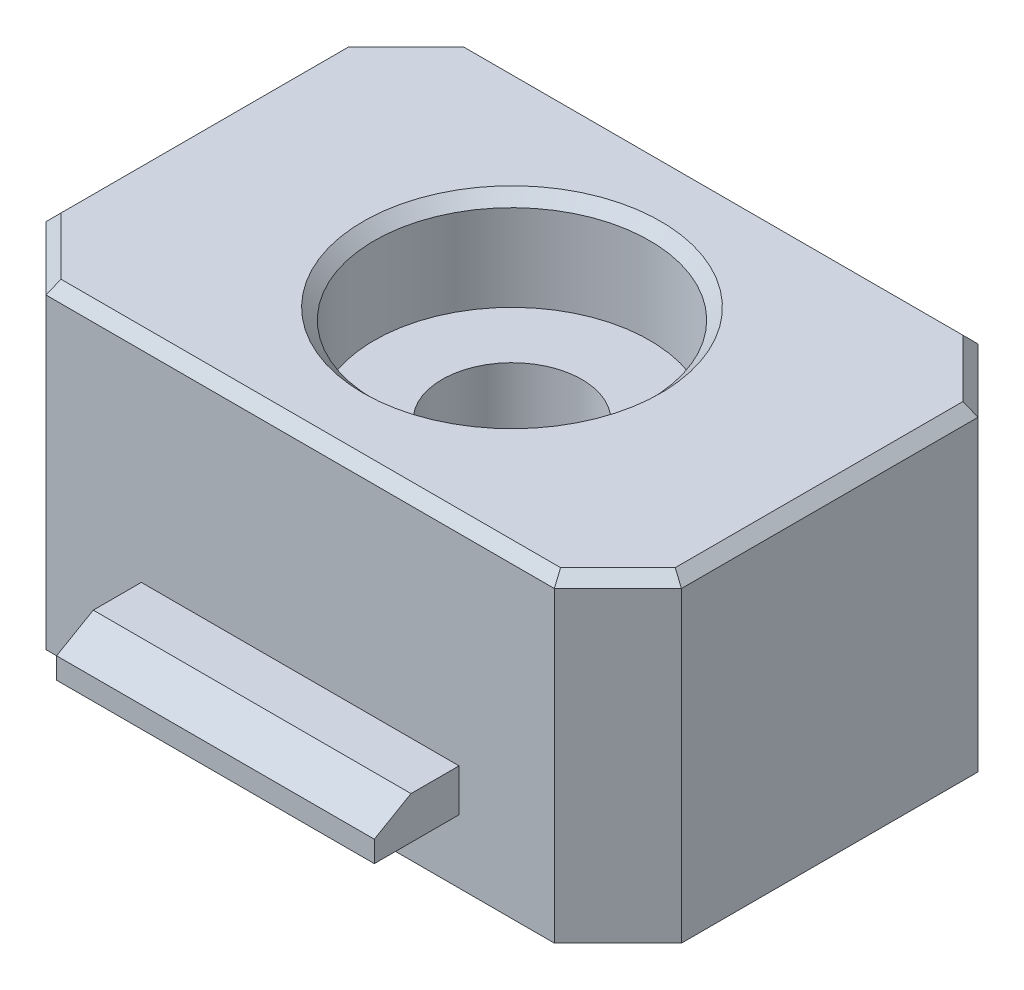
ISO-10303-21;
HEADER;
FILE_DESCRIPTION(('STEP AP214'),'2;1');
FILE_NAME('part.step','',(''),(''),'','','');
FILE_SCHEMA(('AUTOMOTIVE_DESIGN { 1 0 10303 214 1 1 1 1 }'));
ENDSEC;
DATA;
#1=APPLICATION_CONTEXT('core data for automotive mechanical design processes');
#2=APPLICATION_PROTOCOL_DEFINITION('international standard','automotive_design',2000,#1);
#3=PRODUCT_CONTEXT('',#1,'mechanical');
#4=PRODUCT('Part','Part','',(#3));
#5=PRODUCT_RELATED_PRODUCT_CATEGORY('part','',(#4));
#6=PRODUCT_DEFINITION_FORMATION('','',#4);
#7=PRODUCT_DEFINITION_CONTEXT('part definition',#1,'design');
#8=PRODUCT_DEFINITION('design','',#6,#7);
#9=PRODUCT_DEFINITION_SHAPE('','',#8);
#10=(LENGTH_UNIT() NAMED_UNIT(*) SI_UNIT(.MILLI.,.METRE.));
#11=(NAMED_UNIT(*) PLANE_ANGLE_UNIT() SI_UNIT($,.RADIAN.));
#12=(NAMED_UNIT(*) SI_UNIT($,.STERADIAN.) SOLID_ANGLE_UNIT());
#13=UNCERTAINTY_MEASURE_WITH_UNIT(LENGTH_MEASURE(1.E-05),#10,'distance_accuracy_value','');
#14=(GEOMETRIC_REPRESENTATION_CONTEXT(3) GLOBAL_UNCERTAINTY_ASSIGNED_CONTEXT((#13)) GLOBAL_UNIT_ASSIGNED_CONTEXT((#10,
#11,#12)) REPRESENTATION_CONTEXT('',''));
#15=CARTESIAN_POINT('',(0.,0.,0.));
#16=DIRECTION('',(0.,0.,1.));
#17=DIRECTION('',(1.,0.,0.));
#18=AXIS2_PLACEMENT_3D('',#15,#16,#17);
#19=CARTESIAN_POINT('',(15.,15.,-10.));
#20=DIRECTION('',(-1.,0.,0.));
#21=DIRECTION('',(0.,0.,1.));
#22=AXIS2_PLACEMENT_3D('',#19,#20,#21);
#23=PLANE('',#22);
#24=DIRECTION('',(0.,1.,0.));
#25=VECTOR('',#24,1.);
#26=CARTESIAN_POINT('',(15.,15.,-6.99999999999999));
#27=LINE('',#26,#25);
#28=CARTESIAN_POINT('',(15.,0.,-6.99999999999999));
#29=VERTEX_POINT('',#28);
#30=CARTESIAN_POINT('',(15.,14.5,-6.99999999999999));
#31=VERTEX_POINT('',#30);
#32=EDGE_CURVE('E374',#29,#31,#27,.T.);
#33=ORIENTED_EDGE('',*,*,#32,.T.);
#34=DIRECTION('',(0.,0.,1.));
#35=VECTOR('',#34,1.);
#36=CARTESIAN_POINT('',(15.,14.5,7.));
#37=LINE('',#36,#35);
#38=CARTESIAN_POINT('',(15.,14.5,7.));
#39=VERTEX_POINT('',#38);
#40=EDGE_CURVE('E412',#31,#39,#37,.T.);
#41=ORIENTED_EDGE('',*,*,#40,.T.);
#42=DIRECTION('',(0.,-1.,0.));
#43=VECTOR('',#42,1.);
#44=CARTESIAN_POINT('',(15.,15.,7.));
#45=LINE('',#44,#43);
#46=CARTESIAN_POINT('',(15.,0.,7.));
#47=VERTEX_POINT('',#46);
#48=EDGE_CURVE('E371',#39,#47,#45,.T.);
#49=ORIENTED_EDGE('',*,*,#48,.T.);
#50=DIRECTION('',(0.,0.,-1.));
#51=VECTOR('',#50,1.);
#52=CARTESIAN_POINT('',(15.,0.,-10.));
#53=LINE('',#52,#51);
#54=EDGE_CURVE('E328',#47,#29,#53,.T.);
#55=ORIENTED_EDGE('',*,*,#54,.T.);
#56=EDGE_LOOP('',(#33,#41,#49,#55));
#57=FACE_BOUND('',#56,.T.);
#58=ADVANCED_FACE('F41',(#57),#23,.F.);
#59=CARTESIAN_POINT('',(-15.,15.,-10.));
#60=DIRECTION('',(0.,0.,1.));
#61=DIRECTION('',(1.,0.,0.));
#62=AXIS2_PLACEMENT_3D('',#59,#60,#61);
#63=PLANE('',#62);
#64=DIRECTION('',(0.,-1.,0.));
#65=VECTOR('',#64,1.);
#66=CARTESIAN_POINT('',(7.5,5.00000000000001,-10.));
#67=LINE('',#66,#65);
#68=CARTESIAN_POINT('',(7.5,5.00000000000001,-10.));
#69=VERTEX_POINT('',#68);
#70=CARTESIAN_POINT('',(7.5,3.,-10.));
#71=VERTEX_POINT('',#70);
#72=EDGE_CURVE('E235',#69,#71,#67,.T.);
#73=ORIENTED_EDGE('',*,*,#72,.F.);
#74=DIRECTION('',(-1.,0.,0.));
#75=VECTOR('',#74,1.);
#76=CARTESIAN_POINT('',(-7.5,5.00000000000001,-10.));
#77=LINE('',#76,#75);
#78=CARTESIAN_POINT('',(-7.5,5.00000000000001,-10.));
#79=VERTEX_POINT('',#78);
#80=EDGE_CURVE('E231',#69,#79,#77,.T.);
#81=ORIENTED_EDGE('',*,*,#80,.T.);
#82=DIRECTION('',(0.,-1.,0.));
#83=VECTOR('',#82,1.);
#84=CARTESIAN_POINT('',(-7.5,5.00000000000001,-10.));
#85=LINE('',#84,#83);
#86=CARTESIAN_POINT('',(-7.5,3.,-10.));
#87=VERTEX_POINT('',#86);
#88=EDGE_CURVE('E222',#79,#87,#85,.T.);
#89=ORIENTED_EDGE('',*,*,#88,.T.);
#90=DIRECTION('',(-1.,0.,0.));
#91=VECTOR('',#90,1.);
#92=CARTESIAN_POINT('',(-7.5,3.,-10.));
#93=LINE('',#92,#91);
#94=EDGE_CURVE('E228',#71,#87,#93,.T.);
#95=ORIENTED_EDGE('',*,*,#94,.F.);
#96=EDGE_LOOP('',(#73,#81,#89,#95));
#97=FACE_BOUND('',#96,.T.);
#98=DIRECTION('',(0.,1.,0.));
#99=VECTOR('',#98,1.);
#100=CARTESIAN_POINT('',(-12.,15.,-10.));
#101=LINE('',#100,#99);
#102=CARTESIAN_POINT('',(-12.,0.,-10.));
#103=VERTEX_POINT('',#102);
#104=CARTESIAN_POINT('',(-12.,14.5,-10.));
#105=VERTEX_POINT('',#104);
#106=EDGE_CURVE('E367',#103,#105,#101,.T.);
#107=ORIENTED_EDGE('',*,*,#106,.T.);
#108=DIRECTION('',(1.,0.,0.));
#109=VECTOR('',#108,1.);
#110=CARTESIAN_POINT('',(12.,14.5,-10.));
#111=LINE('',#110,#109);
#112=CARTESIAN_POINT('',(12.,14.5,-10.));
#113=VERTEX_POINT('',#112);
#114=EDGE_CURVE('E418',#105,#113,#111,.T.);
#115=ORIENTED_EDGE('',*,*,#114,.T.);
#116=DIRECTION('',(0.,-1.,0.));
#117=VECTOR('',#116,1.);
#118=CARTESIAN_POINT('',(12.,15.,-10.));
#119=LINE('',#118,#117);
#120=CARTESIAN_POINT('',(12.,0.,-10.));
#121=VERTEX_POINT('',#120);
#122=EDGE_CURVE('E364',#113,#121,#119,.T.);
#123=ORIENTED_EDGE('',*,*,#122,.T.);
#124=DIRECTION('',(-1.,0.,0.));
#125=VECTOR('',#124,1.);
#126=CARTESIAN_POINT('',(-15.,0.,-10.));
#127=LINE('',#126,#125);
#128=EDGE_CURVE('E332',#121,#103,#127,.T.);
#129=ORIENTED_EDGE('',*,*,#128,.T.);
#130=EDGE_LOOP('',(#107,#115,#123,#129));
#131=FACE_BOUND('',#130,.T.);
#132=ADVANCED_FACE('F225',(#97,#131),#63,.F.);
#133=CARTESIAN_POINT('',(-15.,15.,-10.));
#134=DIRECTION('',(1.,0.,0.));
#135=DIRECTION('',(0.,0.,-1.));
#136=AXIS2_PLACEMENT_3D('',#133,#134,#135);
#137=PLANE('',#136);
#138=DIRECTION('',(0.,1.,0.));
#139=VECTOR('',#138,1.);
#140=CARTESIAN_POINT('',(-15.,15.,6.99999999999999));
#141=LINE('',#140,#139);
#142=CARTESIAN_POINT('',(-15.,0.,6.99999999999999));
#143=VERTEX_POINT('',#142);
#144=CARTESIAN_POINT('',(-15.,14.5,6.99999999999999));
#145=VERTEX_POINT('',#144);
#146=EDGE_CURVE('E345',#143,#145,#141,.T.);
#147=ORIENTED_EDGE('',*,*,#146,.T.);
#148=DIRECTION('',(0.,0.,-1.));
#149=VECTOR('',#148,1.);
#150=CARTESIAN_POINT('',(-15.,14.5,-7.));
#151=LINE('',#150,#149);
#152=CARTESIAN_POINT('',(-15.,14.5,-7.));
#153=VERTEX_POINT('',#152);
#154=EDGE_CURVE('E424',#145,#153,#151,.T.);
#155=ORIENTED_EDGE('',*,*,#154,.T.);
#156=DIRECTION('',(0.,-1.,0.));
#157=VECTOR('',#156,1.);
#158=CARTESIAN_POINT('',(-15.,15.,-7.));
#159=LINE('',#158,#157);
#160=CARTESIAN_POINT('',(-15.,0.,-7.));
#161=VERTEX_POINT('',#160);
#162=EDGE_CURVE('E349',#153,#161,#159,.T.);
#163=ORIENTED_EDGE('',*,*,#162,.T.);
#164=DIRECTION('',(0.,0.,1.));
#165=VECTOR('',#164,1.);
#166=CARTESIAN_POINT('',(-15.,0.,-10.));
#167=LINE('',#166,#165);
#168=EDGE_CURVE('E337',#161,#143,#167,.T.);
#169=ORIENTED_EDGE('',*,*,#168,.T.);
#170=EDGE_LOOP('',(#147,#155,#163,#169));
#171=FACE_BOUND('',#170,.T.);
#172=ADVANCED_FACE('F500',(#171),#137,.F.);
#173=CARTESIAN_POINT('',(-15.,15.,10.));
#174=DIRECTION('',(0.,0.,-1.));
#175=DIRECTION('',(-1.,0.,0.));
#176=AXIS2_PLACEMENT_3D('',#173,#174,#175);
#177=PLANE('',#176);
#178=DIRECTION('',(0.,-1.,0.));
#179=VECTOR('',#178,1.);
#180=CARTESIAN_POINT('',(-7.5,5.00000000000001,10.));
#181=LINE('',#180,#179);
#182=CARTESIAN_POINT('',(-7.5,5.00000000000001,10.));
#183=VERTEX_POINT('',#182);
#184=CARTESIAN_POINT('',(-7.5,3.,10.));
#185=VERTEX_POINT('',#184);
#186=EDGE_CURVE('E282',#183,#185,#181,.T.);
#187=ORIENTED_EDGE('',*,*,#186,.F.);
#188=DIRECTION('',(-1.,0.,0.));
#189=VECTOR('',#188,1.);
#190=CARTESIAN_POINT('',(-7.5,5.00000000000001,10.));
#191=LINE('',#190,#189);
#192=CARTESIAN_POINT('',(7.5,5.00000000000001,10.));
#193=VERTEX_POINT('',#192);
#194=EDGE_CURVE('E278',#193,#183,#191,.T.);
#195=ORIENTED_EDGE('',*,*,#194,.F.);
#196=DIRECTION('',(0.,-1.,0.));
#197=VECTOR('',#196,1.);
#198=CARTESIAN_POINT('',(7.5,5.00000000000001,10.));
#199=LINE('',#198,#197);
#200=CARTESIAN_POINT('',(7.5,3.,10.));
#201=VERTEX_POINT('',#200);
#202=EDGE_CURVE('E299',#193,#201,#199,.T.);
#203=ORIENTED_EDGE('',*,*,#202,.T.);
#204=DIRECTION('',(-1.,0.,0.));
#205=VECTOR('',#204,1.);
#206=CARTESIAN_POINT('',(-7.5,3.,10.));
#207=LINE('',#206,#205);
#208=EDGE_CURVE('E275',#201,#185,#207,.T.);
#209=ORIENTED_EDGE('',*,*,#208,.T.);
#210=EDGE_LOOP('',(#187,#195,#203,#209));
#211=FACE_BOUND('',#210,.T.);
#212=DIRECTION('',(0.,1.,0.));
#213=VECTOR('',#212,1.);
#214=CARTESIAN_POINT('',(12.,15.,10.));
#215=LINE('',#214,#213);
#216=CARTESIAN_POINT('',(12.,0.,10.));
#217=VERTEX_POINT('',#216);
#218=CARTESIAN_POINT('',(12.,14.5,10.));
#219=VERTEX_POINT('',#218);
#220=EDGE_CURVE('E381',#217,#219,#215,.T.);
#221=ORIENTED_EDGE('',*,*,#220,.T.);
#222=DIRECTION('',(-1.,0.,0.));
#223=VECTOR('',#222,1.);
#224=CARTESIAN_POINT('',(-12.,14.5,10.));
#225=LINE('',#224,#223);
#226=CARTESIAN_POINT('',(-12.,14.5,10.));
#227=VERTEX_POINT('',#226);
#228=EDGE_CURVE('E429',#219,#227,#225,.T.);
#229=ORIENTED_EDGE('',*,*,#228,.T.);
#230=DIRECTION('',(0.,-1.,0.));
#231=VECTOR('',#230,1.);
#232=CARTESIAN_POINT('',(-12.,15.,10.));
#233=LINE('',#232,#231);
#234=CARTESIAN_POINT('',(-12.,0.,10.));
#235=VERTEX_POINT('',#234);
#236=EDGE_CURVE('E378',#227,#235,#233,.T.);
#237=ORIENTED_EDGE('',*,*,#236,.T.);
#238=DIRECTION('',(1.,0.,0.));
#239=VECTOR('',#238,1.);
#240=CARTESIAN_POINT('',(-15.,0.,10.));
#241=LINE('',#240,#239);
#242=EDGE_CURVE('E341',#235,#217,#241,.T.);
#243=ORIENTED_EDGE('',*,*,#242,.T.);
#244=EDGE_LOOP('',(#221,#229,#237,#243));
#245=FACE_BOUND('',#244,.T.);
#246=ADVANCED_FACE('F577',(#211,#245),#177,.F.);
#247=CARTESIAN_POINT('',(0.,15.,0.));
#248=DIRECTION('',(0.,1.,0.));
#249=DIRECTION('',(0.,0.,1.));
#250=AXIS2_PLACEMENT_3D('',#247,#248,#249);
#251=PLANE('',#250);
#252=CARTESIAN_POINT('',(0.,15.,0.));
#253=DIRECTION('',(0.,1.,0.));
#254=DIRECTION('',(0.,0.,1.));
#255=AXIS2_PLACEMENT_3D('',#252,#253,#254);
#256=CIRCLE('',#255,7.025);
#257=CARTESIAN_POINT('',(0.,15.,7.025));
#258=VERTEX_POINT('',#257);
#259=EDGE_CURVE('E308',#258,#258,#256,.T.);
#260=ORIENTED_EDGE('',*,*,#259,.F.);
#261=EDGE_LOOP('',(#260));
#262=FACE_BOUND('',#261,.T.);
#263=DIRECTION('',(1.,0.,0.));
#264=VECTOR('',#263,1.);
#265=CARTESIAN_POINT('',(12.,15.,9.5));
#266=LINE('',#265,#264);
#267=CARTESIAN_POINT('',(-11.7928932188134,15.,9.5));
#268=VERTEX_POINT('',#267);
#269=CARTESIAN_POINT('',(11.7928932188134,15.,9.5));
#270=VERTEX_POINT('',#269);
#271=EDGE_CURVE('E385',#268,#270,#266,.T.);
#272=ORIENTED_EDGE('',*,*,#271,.T.);
#273=DIRECTION('',(0.707106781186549,0.,-0.707106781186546));
#274=VECTOR('',#273,1.);
#275=CARTESIAN_POINT('',(10.6464466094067,15.,10.6464466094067));
#276=LINE('',#275,#274);
#277=CARTESIAN_POINT('',(14.5,15.,6.79289321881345));
#278=VERTEX_POINT('',#277);
#279=EDGE_CURVE('E405',#270,#278,#276,.T.);
#280=ORIENTED_EDGE('',*,*,#279,.T.);
#281=DIRECTION('',(0.,0.,-1.));
#282=VECTOR('',#281,1.);
#283=CARTESIAN_POINT('',(14.5,15.,-6.99999999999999));
#284=LINE('',#283,#282);
#285=CARTESIAN_POINT('',(14.5,15.,-6.79289321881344));
#286=VERTEX_POINT('',#285);
#287=EDGE_CURVE('E402',#278,#286,#284,.T.);
#288=ORIENTED_EDGE('',*,*,#287,.T.);
#289=DIRECTION('',(-0.707106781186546,0.,-0.707106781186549));
#290=VECTOR('',#289,1.);
#291=CARTESIAN_POINT('',(10.6464466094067,15.,-10.6464466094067));
#292=LINE('',#291,#290);
#293=CARTESIAN_POINT('',(11.7928932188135,15.,-9.5));
#294=VERTEX_POINT('',#293);
#295=EDGE_CURVE('E399',#286,#294,#292,.T.);
#296=ORIENTED_EDGE('',*,*,#295,.T.);
#297=DIRECTION('',(-1.,0.,0.));
#298=VECTOR('',#297,1.);
#299=CARTESIAN_POINT('',(-12.,15.,-9.5));
#300=LINE('',#299,#298);
#301=CARTESIAN_POINT('',(-11.7928932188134,15.,-9.5));
#302=VERTEX_POINT('',#301);
#303=EDGE_CURVE('E396',#294,#302,#300,.T.);
#304=ORIENTED_EDGE('',*,*,#303,.T.);
#305=DIRECTION('',(-0.707106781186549,0.,0.707106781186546));
#306=VECTOR('',#305,1.);
#307=CARTESIAN_POINT('',(-10.6464466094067,15.,-10.6464466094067));
#308=LINE('',#307,#306);
#309=CARTESIAN_POINT('',(-14.5,15.,-6.79289321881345));
#310=VERTEX_POINT('',#309);
#311=EDGE_CURVE('E393',#302,#310,#308,.T.);
#312=ORIENTED_EDGE('',*,*,#311,.T.);
#313=DIRECTION('',(0.,0.,1.));
#314=VECTOR('',#313,1.);
#315=CARTESIAN_POINT('',(-14.5,15.,6.99999999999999));
#316=LINE('',#315,#314);
#317=CARTESIAN_POINT('',(-14.5,15.,6.79289321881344));
#318=VERTEX_POINT('',#317);
#319=EDGE_CURVE('E390',#310,#318,#316,.T.);
#320=ORIENTED_EDGE('',*,*,#319,.T.);
#321=DIRECTION('',(0.707106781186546,0.,0.707106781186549));
#322=VECTOR('',#321,1.);
#323=CARTESIAN_POINT('',(-10.6464466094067,15.,10.6464466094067));
#324=LINE('',#323,#322);
#325=EDGE_CURVE('E388',#318,#268,#324,.T.);
#326=ORIENTED_EDGE('',*,*,#325,.T.);
#327=EDGE_LOOP('',(#272,#280,#288,#296,#304,#312,#320,#326));
#328=FACE_BOUND('',#327,.T.);
#329=ADVANCED_FACE('F612',(#262,#328),#251,.T.);
#330=CARTESIAN_POINT('',(0.,0.,0.));
#331=DIRECTION('',(0.,1.,0.));
#332=DIRECTION('',(0.,0.,1.));
#333=AXIS2_PLACEMENT_3D('',#330,#331,#332);
#334=PLANE('',#333);
#335=CARTESIAN_POINT('',(0.,0.,0.));
#336=DIRECTION('',(0.,1.,0.));
#337=DIRECTION('',(0.,0.,1.));
#338=AXIS2_PLACEMENT_3D('',#335,#336,#337);
#339=CIRCLE('',#338,3.30000000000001);
#340=CARTESIAN_POINT('',(0.,0.,3.30000000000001));
#341=VERTEX_POINT('',#340);
#342=EDGE_CURVE('E323',#341,#341,#339,.T.);
#343=ORIENTED_EDGE('',*,*,#342,.T.);
#344=EDGE_LOOP('',(#343));
#345=FACE_BOUND('',#344,.T.);
#346=ORIENTED_EDGE('',*,*,#168,.F.);
#347=DIRECTION('',(-0.707106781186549,0.,0.707106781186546));
#348=VECTOR('',#347,1.);
#349=CARTESIAN_POINT('',(-15.,0.,-7.));
#350=LINE('',#349,#348);
#351=EDGE_CURVE('E361',#161,#103,#350,.F.);
#352=ORIENTED_EDGE('',*,*,#351,.T.);
#353=ORIENTED_EDGE('',*,*,#128,.F.);
#354=DIRECTION('',(-0.707106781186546,0.,-0.707106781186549));
#355=VECTOR('',#354,1.);
#356=CARTESIAN_POINT('',(12.,0.,-10.));
#357=LINE('',#356,#355);
#358=EDGE_CURVE('E358',#121,#29,#357,.F.);
#359=ORIENTED_EDGE('',*,*,#358,.T.);
#360=ORIENTED_EDGE('',*,*,#54,.F.);
#361=DIRECTION('',(0.707106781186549,0.,-0.707106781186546));
#362=VECTOR('',#361,1.);
#363=CARTESIAN_POINT('',(15.,0.,7.));
#364=LINE('',#363,#362);
#365=EDGE_CURVE('E355',#47,#217,#364,.F.);
#366=ORIENTED_EDGE('',*,*,#365,.T.);
#367=ORIENTED_EDGE('',*,*,#242,.F.);
#368=DIRECTION('',(0.707106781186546,0.,0.707106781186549));
#369=VECTOR('',#368,1.);
#370=CARTESIAN_POINT('',(-12.,0.,10.));
#371=LINE('',#370,#369);
#372=EDGE_CURVE('E352',#235,#143,#371,.F.);
#373=ORIENTED_EDGE('',*,*,#372,.T.);
#374=EDGE_LOOP('',(#346,#352,#353,#359,#360,#366,#367,#373));
#375=FACE_BOUND('',#374,.T.);
#376=ADVANCED_FACE('F508',(#345,#375),#334,.F.);
#377=CARTESIAN_POINT('',(-15.,15.,-7.));
#378=DIRECTION('',(0.707106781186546,0.,0.707106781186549));
#379=DIRECTION('',(0.,-1.,0.));
#380=AXIS2_PLACEMENT_3D('',#377,#378,#379);
#381=PLANE('',#380);
#382=ORIENTED_EDGE('',*,*,#162,.F.);
#383=DIRECTION('',(-0.707106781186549,0.,0.707106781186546));
#384=VECTOR('',#383,1.);
#385=CARTESIAN_POINT('',(-15.,14.5,-7.));
#386=LINE('',#385,#384);
#387=EDGE_CURVE('E421',#153,#105,#386,.F.);
#388=ORIENTED_EDGE('',*,*,#387,.T.);
#389=ORIENTED_EDGE('',*,*,#106,.F.);
#390=ORIENTED_EDGE('',*,*,#351,.F.);
#391=EDGE_LOOP('',(#382,#388,#389,#390));
#392=FACE_BOUND('',#391,.T.);
#393=ADVANCED_FACE('F504',(#392),#381,.F.);
#394=CARTESIAN_POINT('',(12.,15.,-10.));
#395=DIRECTION('',(-0.707106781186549,0.,0.707106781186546));
#396=DIRECTION('',(0.,-1.,0.));
#397=AXIS2_PLACEMENT_3D('',#394,#395,#396);
#398=PLANE('',#397);
#399=ORIENTED_EDGE('',*,*,#122,.F.);
#400=DIRECTION('',(-0.707106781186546,0.,-0.707106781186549));
#401=VECTOR('',#400,1.);
#402=CARTESIAN_POINT('',(12.,14.5,-10.));
#403=LINE('',#402,#401);
#404=EDGE_CURVE('E415',#113,#31,#403,.F.);
#405=ORIENTED_EDGE('',*,*,#404,.T.);
#406=ORIENTED_EDGE('',*,*,#32,.F.);
#407=ORIENTED_EDGE('',*,*,#358,.F.);
#408=EDGE_LOOP('',(#399,#405,#406,#407));
#409=FACE_BOUND('',#408,.T.);
#410=ADVANCED_FACE('F507',(#409),#398,.F.);
#411=CARTESIAN_POINT('',(15.,15.,7.));
#412=DIRECTION('',(-0.707106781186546,0.,-0.707106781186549));
#413=DIRECTION('',(0.,-1.,0.));
#414=AXIS2_PLACEMENT_3D('',#411,#412,#413);
#415=PLANE('',#414);
#416=ORIENTED_EDGE('',*,*,#48,.F.);
#417=DIRECTION('',(0.707106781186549,0.,-0.707106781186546));
#418=VECTOR('',#417,1.);
#419=CARTESIAN_POINT('',(15.,14.5,7.));
#420=LINE('',#419,#418);
#421=EDGE_CURVE('E409',#39,#219,#420,.F.);
#422=ORIENTED_EDGE('',*,*,#421,.T.);
#423=ORIENTED_EDGE('',*,*,#220,.F.);
#424=ORIENTED_EDGE('',*,*,#365,.F.);
#425=EDGE_LOOP('',(#416,#422,#423,#424));
#426=FACE_BOUND('',#425,.T.);
#427=ADVANCED_FACE('F512',(#426),#415,.F.);
#428=CARTESIAN_POINT('',(-12.,15.,10.));
#429=DIRECTION('',(0.707106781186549,0.,-0.707106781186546));
#430=DIRECTION('',(0.,-1.,0.));
#431=AXIS2_PLACEMENT_3D('',#428,#429,#430);
#432=PLANE('',#431);
#433=ORIENTED_EDGE('',*,*,#236,.F.);
#434=DIRECTION('',(0.707106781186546,0.,0.707106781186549));
#435=VECTOR('',#434,1.);
#436=CARTESIAN_POINT('',(-12.,14.5,10.));
#437=LINE('',#436,#435);
#438=EDGE_CURVE('E427',#227,#145,#437,.F.);
#439=ORIENTED_EDGE('',*,*,#438,.T.);
#440=ORIENTED_EDGE('',*,*,#146,.F.);
#441=ORIENTED_EDGE('',*,*,#372,.F.);
#442=EDGE_LOOP('',(#433,#439,#440,#441));
#443=FACE_BOUND('',#442,.T.);
#444=ADVANCED_FACE('F516',(#443),#432,.F.);
#445=CARTESIAN_POINT('',(-10.6464466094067,15.,-10.6464466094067));
#446=DIRECTION('',(-0.499999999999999,0.707106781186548,-0.500000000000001));
#447=DIRECTION('',(0.707106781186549,0.,-0.707106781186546));
#448=AXIS2_PLACEMENT_3D('',#445,#446,#447);
#449=PLANE('',#448);
#450=DIRECTION('',(-0.28108463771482,-0.678598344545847,-0.678598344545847));
#451=VECTOR('',#450,1.);
#452=CARTESIAN_POINT('',(-11.9209914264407,14.6907435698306,-9.80925643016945));
#453=LINE('',#452,#451);
#454=EDGE_CURVE('E450',#105,#302,#453,.F.);
#455=ORIENTED_EDGE('',*,*,#454,.F.);
#456=ORIENTED_EDGE('',*,*,#387,.F.);
#457=DIRECTION('',(-0.678598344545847,-0.678598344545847,-0.281084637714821));
#458=VECTOR('',#457,1.);
#459=CARTESIAN_POINT('',(-13.2042992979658,16.2957007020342,-6.25619641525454));
#460=LINE('',#459,#458);
#461=EDGE_CURVE('E333',#310,#153,#460,.T.);
#462=ORIENTED_EDGE('',*,*,#461,.F.);
#463=ORIENTED_EDGE('',*,*,#311,.F.);
#464=EDGE_LOOP('',(#455,#456,#462,#463));
#465=FACE_BOUND('',#464,.T.);
#466=ADVANCED_FACE('F520',(#465),#449,.T.);
#467=CARTESIAN_POINT('',(-14.5,15.,0.));
#468=DIRECTION('',(-0.707106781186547,0.707106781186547,0.));
#469=DIRECTION('',(0.,0.,-1.));
#470=AXIS2_PLACEMENT_3D('',#467,#468,#469);
#471=PLANE('',#470);
#472=ORIENTED_EDGE('',*,*,#461,.T.);
#473=ORIENTED_EDGE('',*,*,#154,.F.);
#474=DIRECTION('',(-0.678598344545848,-0.678598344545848,0.281084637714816));
#475=VECTOR('',#474,1.);
#476=CARTESIAN_POINT('',(-13.4604957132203,16.0395042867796,6.36231644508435));
#477=LINE('',#476,#475);
#478=EDGE_CURVE('E447',#318,#145,#477,.T.);
#479=ORIENTED_EDGE('',*,*,#478,.F.);
#480=ORIENTED_EDGE('',*,*,#319,.F.);
#481=EDGE_LOOP('',(#472,#473,#479,#480));
#482=FACE_BOUND('',#481,.T.);
#483=ADVANCED_FACE('F546',(#482),#471,.T.);
#484=CARTESIAN_POINT('',(0.,15.,-9.5));
#485=DIRECTION('',(0.,0.707106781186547,-0.707106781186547));
#486=DIRECTION('',(1.,0.,0.));
#487=AXIS2_PLACEMENT_3D('',#484,#485,#486);
#488=PLANE('',#487);
#489=ORIENTED_EDGE('',*,*,#454,.T.);
#490=ORIENTED_EDGE('',*,*,#303,.F.);
#491=DIRECTION('',(0.281084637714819,-0.678598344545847,-0.678598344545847));
#492=VECTOR('',#491,1.);
#493=CARTESIAN_POINT('',(10.8611535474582,17.2494185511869,-7.25058144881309));
#494=LINE('',#493,#492);
#495=EDGE_CURVE('E443',#113,#294,#494,.F.);
#496=ORIENTED_EDGE('',*,*,#495,.F.);
#497=ORIENTED_EDGE('',*,*,#114,.F.);
#498=EDGE_LOOP('',(#489,#490,#496,#497));
#499=FACE_BOUND('',#498,.T.);
#500=ADVANCED_FACE('F542',(#499),#488,.T.);
#501=CARTESIAN_POINT('',(-10.6464466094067,15.,10.6464466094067));
#502=DIRECTION('',(-0.500000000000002,0.707106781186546,0.5));
#503=DIRECTION('',(-0.707106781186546,0.,-0.707106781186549));
#504=AXIS2_PLACEMENT_3D('',#501,#502,#503);
#505=PLANE('',#504);
#506=ORIENTED_EDGE('',*,*,#478,.T.);
#507=ORIENTED_EDGE('',*,*,#438,.F.);
#508=DIRECTION('',(-0.281084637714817,-0.678598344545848,0.678598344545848));
#509=VECTOR('',#508,1.);
#510=CARTESIAN_POINT('',(-10.8611535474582,17.2494185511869,7.2505814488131));
#511=LINE('',#510,#509);
#512=EDGE_CURVE('E440',#268,#227,#511,.T.);
#513=ORIENTED_EDGE('',*,*,#512,.F.);
#514=ORIENTED_EDGE('',*,*,#325,.F.);
#515=EDGE_LOOP('',(#506,#507,#513,#514));
#516=FACE_BOUND('',#515,.T.);
#517=ADVANCED_FACE('F538',(#516),#505,.T.);
#518=CARTESIAN_POINT('',(10.6464466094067,15.,-10.6464466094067));
#519=DIRECTION('',(0.500000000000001,0.707106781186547,-0.5));
#520=DIRECTION('',(0.707106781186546,0.,0.707106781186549));
#521=AXIS2_PLACEMENT_3D('',#518,#519,#520);
#522=PLANE('',#521);
#523=ORIENTED_EDGE('',*,*,#495,.T.);
#524=ORIENTED_EDGE('',*,*,#295,.F.);
#525=DIRECTION('',(0.678598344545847,-0.678598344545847,-0.281084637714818));
#526=VECTOR('',#525,1.);
#527=CARTESIAN_POINT('',(13.4604957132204,16.0395042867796,-6.36231644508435));
#528=LINE('',#527,#526);
#529=EDGE_CURVE('E437',#31,#286,#528,.F.);
#530=ORIENTED_EDGE('',*,*,#529,.F.);
#531=ORIENTED_EDGE('',*,*,#404,.F.);
#532=EDGE_LOOP('',(#523,#524,#530,#531));
#533=FACE_BOUND('',#532,.T.);
#534=ADVANCED_FACE('F534',(#533),#522,.T.);
#535=CARTESIAN_POINT('',(0.,15.,9.5));
#536=DIRECTION('',(0.,0.707106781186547,0.707106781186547));
#537=DIRECTION('',(-1.,0.,0.));
#538=AXIS2_PLACEMENT_3D('',#535,#536,#537);
#539=PLANE('',#538);
#540=ORIENTED_EDGE('',*,*,#512,.T.);
#541=ORIENTED_EDGE('',*,*,#228,.F.);
#542=DIRECTION('',(-0.28108463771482,0.678598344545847,-0.678598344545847));
#543=VECTOR('',#542,1.);
#544=CARTESIAN_POINT('',(10.8611535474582,17.2494185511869,7.25058144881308));
#545=LINE('',#544,#543);
#546=EDGE_CURVE('E435',#270,#219,#545,.F.);
#547=ORIENTED_EDGE('',*,*,#546,.F.);
#548=ORIENTED_EDGE('',*,*,#271,.F.);
#549=EDGE_LOOP('',(#540,#541,#547,#548));
#550=FACE_BOUND('',#549,.T.);
#551=ADVANCED_FACE('F530',(#550),#539,.T.);
#552=CARTESIAN_POINT('',(14.5,15.,0.));
#553=DIRECTION('',(0.707106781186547,0.707106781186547,0.));
#554=DIRECTION('',(0.,0.,1.));
#555=AXIS2_PLACEMENT_3D('',#552,#553,#554);
#556=PLANE('',#555);
#557=ORIENTED_EDGE('',*,*,#529,.T.);
#558=ORIENTED_EDGE('',*,*,#287,.F.);
#559=DIRECTION('',(0.678598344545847,-0.678598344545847,0.281084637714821));
#560=VECTOR('',#559,1.);
#561=CARTESIAN_POINT('',(13.2042992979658,16.2957007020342,6.25619641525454));
#562=LINE('',#561,#560);
#563=EDGE_CURVE('E327',#39,#278,#562,.F.);
#564=ORIENTED_EDGE('',*,*,#563,.F.);
#565=ORIENTED_EDGE('',*,*,#40,.F.);
#566=EDGE_LOOP('',(#557,#558,#564,#565));
#567=FACE_BOUND('',#566,.T.);
#568=ADVANCED_FACE('F526',(#567),#556,.T.);
#569=CARTESIAN_POINT('',(10.6464466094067,15.,10.6464466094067));
#570=DIRECTION('',(0.499999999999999,0.707106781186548,0.500000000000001));
#571=DIRECTION('',(-0.707106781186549,0.,0.707106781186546));
#572=AXIS2_PLACEMENT_3D('',#569,#570,#571);
#573=PLANE('',#572);
#574=ORIENTED_EDGE('',*,*,#546,.T.);
#575=ORIENTED_EDGE('',*,*,#421,.F.);
#576=ORIENTED_EDGE('',*,*,#563,.T.);
#577=ORIENTED_EDGE('',*,*,#279,.F.);
#578=EDGE_LOOP('',(#574,#575,#576,#577));
#579=FACE_BOUND('',#578,.T.);
#580=ADVANCED_FACE('F522',(#579),#573,.T.);
#581=CARTESIAN_POINT('',(0.,15.,0.));
#582=DIRECTION('',(0.,1.,0.));
#583=DIRECTION('',(0.,0.,1.));
#584=AXIS2_PLACEMENT_3D('',#581,#582,#583);
#585=CYLINDRICAL_SURFACE('',#584,3.3);
#586=ORIENTED_EDGE('',*,*,#342,.F.);
#587=EDGE_LOOP('',(#586));
#588=FACE_BOUND('',#587,.T.);
#589=CARTESIAN_POINT('',(0.,10.4,0.));
#590=DIRECTION('',(0.,1.,0.));
#591=DIRECTION('',(0.,0.,1.));
#592=AXIS2_PLACEMENT_3D('',#589,#590,#591);
#593=CIRCLE('',#592,3.3);
#594=CARTESIAN_POINT('',(0.,10.4,3.3));
#595=VERTEX_POINT('',#594);
#596=EDGE_CURVE('E319',#595,#595,#593,.T.);
#597=ORIENTED_EDGE('',*,*,#596,.T.);
#598=EDGE_LOOP('',(#597));
#599=FACE_BOUND('',#598,.T.);
#600=ADVANCED_FACE('F525',(#588,#599),#585,.F.);
#601=CARTESIAN_POINT('',(6.5,10.4,0.));
#602=DIRECTION('',(0.,-1.,0.));
#603=DIRECTION('',(0.,0.,-1.));
#604=AXIS2_PLACEMENT_3D('',#601,#602,#603);
#605=PLANE('',#604);
#606=ORIENTED_EDGE('',*,*,#596,.F.);
#607=EDGE_LOOP('',(#606));
#608=FACE_BOUND('',#607,.T.);
#609=CARTESIAN_POINT('',(0.,10.4,0.));
#610=DIRECTION('',(0.,1.,0.));
#611=DIRECTION('',(0.,0.,1.));
#612=AXIS2_PLACEMENT_3D('',#609,#610,#611);
#613=CIRCLE('',#612,6.5);
#614=CARTESIAN_POINT('',(0.,10.4,6.5));
#615=VERTEX_POINT('',#614);
#616=EDGE_CURVE('E316',#615,#615,#613,.T.);
#617=ORIENTED_EDGE('',*,*,#616,.T.);
#618=EDGE_LOOP('',(#617));
#619=FACE_BOUND('',#618,.T.);
#620=ADVANCED_FACE('F604',(#608,#619),#605,.F.);
#621=CARTESIAN_POINT('',(0.,15.,0.));
#622=DIRECTION('',(0.,1.,0.));
#623=DIRECTION('',(0.,0.,1.));
#624=AXIS2_PLACEMENT_3D('',#621,#622,#623);
#625=CYLINDRICAL_SURFACE('',#624,6.5);
#626=ORIENTED_EDGE('',*,*,#616,.F.);
#627=EDGE_LOOP('',(#626));
#628=FACE_BOUND('',#627,.T.);
#629=CARTESIAN_POINT('',(0.,14.475,0.));
#630=DIRECTION('',(0.,1.,0.));
#631=DIRECTION('',(0.,0.,1.));
#632=AXIS2_PLACEMENT_3D('',#629,#630,#631);
#633=CIRCLE('',#632,6.5);
#634=CARTESIAN_POINT('',(0.,14.475,6.5));
#635=VERTEX_POINT('',#634);
#636=EDGE_CURVE('E312',#635,#635,#633,.T.);
#637=ORIENTED_EDGE('',*,*,#636,.T.);
#638=EDGE_LOOP('',(#637));
#639=FACE_BOUND('',#638,.T.);
#640=ADVANCED_FACE('F600',(#628,#639),#625,.F.);
#641=CARTESIAN_POINT('',(0.,15.,0.));
#642=DIRECTION('',(0.,1.,0.));
#643=DIRECTION('',(0.,0.,1.));
#644=AXIS2_PLACEMENT_3D('',#641,#642,#643);
#645=CONICAL_SURFACE('',#644,7.025,0.785398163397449);
#646=ORIENTED_EDGE('',*,*,#636,.F.);
#647=EDGE_LOOP('',(#646));
#648=FACE_BOUND('',#647,.T.);
#649=ORIENTED_EDGE('',*,*,#259,.T.);
#650=EDGE_LOOP('',(#649));
#651=FACE_BOUND('',#650,.T.);
#652=ADVANCED_FACE('F595',(#648,#651),#645,.F.);
#653=CARTESIAN_POINT('',(-7.5,5.00000000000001,10.));
#654=DIRECTION('',(1.,0.,0.));
#655=DIRECTION('',(0.,0.,-1.));
#656=AXIS2_PLACEMENT_3D('',#653,#654,#655);
#657=PLANE('',#656);
#658=DIRECTION('',(0.,-1.,0.));
#659=VECTOR('',#658,1.);
#660=CARTESIAN_POINT('',(-7.5,5.00000000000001,14.));
#661=LINE('',#660,#659);
#662=CARTESIAN_POINT('',(-7.5,4.00000000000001,14.));
#663=VERTEX_POINT('',#662);
#664=CARTESIAN_POINT('',(-7.5,3.,14.));
#665=VERTEX_POINT('',#664);
#666=EDGE_CURVE('E305',#663,#665,#661,.T.);
#667=ORIENTED_EDGE('',*,*,#666,.F.);
#668=DIRECTION('',(0.,0.500000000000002,-0.866025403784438));
#669=VECTOR('',#668,1.);
#670=CARTESIAN_POINT('',(-7.5,5.00000000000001,12.2679491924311));
#671=LINE('',#670,#669);
#672=CARTESIAN_POINT('',(-7.5,5.00000000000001,12.2679491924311));
#673=VERTEX_POINT('',#672);
#674=EDGE_CURVE('E465',#663,#673,#671,.T.);
#675=ORIENTED_EDGE('',*,*,#674,.T.);
#676=DIRECTION('',(0.,0.,1.));
#677=VECTOR('',#676,1.);
#678=CARTESIAN_POINT('',(-7.5,5.00000000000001,10.));
#679=LINE('',#678,#677);
#680=EDGE_CURVE('E270',#183,#673,#679,.T.);
#681=ORIENTED_EDGE('',*,*,#680,.F.);
#682=ORIENTED_EDGE('',*,*,#186,.T.);
#683=DIRECTION('',(0.,0.,1.));
#684=VECTOR('',#683,1.);
#685=CARTESIAN_POINT('',(-7.5,3.,10.));
#686=LINE('',#685,#684);
#687=EDGE_CURVE('E234',#185,#665,#686,.T.);
#688=ORIENTED_EDGE('',*,*,#687,.T.);
#689=EDGE_LOOP('',(#667,#675,#681,#682,#688));
#690=FACE_BOUND('',#689,.T.);
#691=ADVANCED_FACE('F571',(#690),#657,.F.);
#692=CARTESIAN_POINT('',(-7.5,5.00000000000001,14.));
#693=DIRECTION('',(0.,0.,-1.));
#694=DIRECTION('',(-1.,0.,0.));
#695=AXIS2_PLACEMENT_3D('',#692,#693,#694);
#696=PLANE('',#695);
#697=DIRECTION('',(0.,-1.,0.));
#698=VECTOR('',#697,1.);
#699=CARTESIAN_POINT('',(7.5,5.00000000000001,14.));
#700=LINE('',#699,#698);
#701=CARTESIAN_POINT('',(7.5,4.00000000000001,14.));
#702=VERTEX_POINT('',#701);
#703=CARTESIAN_POINT('',(7.5,3.,14.));
#704=VERTEX_POINT('',#703);
#705=EDGE_CURVE('E302',#702,#704,#700,.T.);
#706=ORIENTED_EDGE('',*,*,#705,.F.);
#707=DIRECTION('',(-1.,0.,0.));
#708=VECTOR('',#707,1.);
#709=CARTESIAN_POINT('',(-7.5,4.00000000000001,14.));
#710=LINE('',#709,#708);
#711=EDGE_CURVE('E462',#702,#663,#710,.T.);
#712=ORIENTED_EDGE('',*,*,#711,.T.);
#713=ORIENTED_EDGE('',*,*,#666,.T.);
#714=DIRECTION('',(1.,0.,0.));
#715=VECTOR('',#714,1.);
#716=CARTESIAN_POINT('',(-7.5,3.,14.));
#717=LINE('',#716,#715);
#718=EDGE_CURVE('E286',#665,#704,#717,.T.);
#719=ORIENTED_EDGE('',*,*,#718,.T.);
#720=EDGE_LOOP('',(#706,#712,#713,#719));
#721=FACE_BOUND('',#720,.T.);
#722=ADVANCED_FACE('F587',(#721),#696,.F.);
#723=CARTESIAN_POINT('',(7.5,5.00000000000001,10.));
#724=DIRECTION('',(-1.,0.,0.));
#725=DIRECTION('',(0.,0.,1.));
#726=AXIS2_PLACEMENT_3D('',#723,#724,#725);
#727=PLANE('',#726);
#728=DIRECTION('',(0.,0.,-1.));
#729=VECTOR('',#728,1.);
#730=CARTESIAN_POINT('',(7.5,5.00000000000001,10.));
#731=LINE('',#730,#729);
#732=CARTESIAN_POINT('',(7.5,5.00000000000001,12.2679491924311));
#733=VERTEX_POINT('',#732);
#734=EDGE_CURVE('E274',#733,#193,#731,.T.);
#735=ORIENTED_EDGE('',*,*,#734,.F.);
#736=DIRECTION('',(0.,-0.500000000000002,0.866025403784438));
#737=VECTOR('',#736,1.);
#738=CARTESIAN_POINT('',(7.5,5.00000000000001,12.2679491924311));
#739=LINE('',#738,#737);
#740=EDGE_CURVE('E460',#733,#702,#739,.T.);
#741=ORIENTED_EDGE('',*,*,#740,.T.);
#742=ORIENTED_EDGE('',*,*,#705,.T.);
#743=DIRECTION('',(0.,0.,-1.));
#744=VECTOR('',#743,1.);
#745=CARTESIAN_POINT('',(7.5,3.,10.));
#746=LINE('',#745,#744);
#747=EDGE_CURVE('E290',#704,#201,#746,.T.);
#748=ORIENTED_EDGE('',*,*,#747,.T.);
#749=ORIENTED_EDGE('',*,*,#202,.F.);
#750=EDGE_LOOP('',(#735,#741,#742,#748,#749));
#751=FACE_BOUND('',#750,.T.);
#752=ADVANCED_FACE('F580',(#751),#727,.F.);
#753=CARTESIAN_POINT('',(0.,5.00000000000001,0.));
#754=DIRECTION('',(0.,1.,0.));
#755=DIRECTION('',(0.,0.,1.));
#756=AXIS2_PLACEMENT_3D('',#753,#754,#755);
#757=PLANE('',#756);
#758=ORIENTED_EDGE('',*,*,#680,.T.);
#759=DIRECTION('',(1.,0.,0.));
#760=VECTOR('',#759,1.);
#761=CARTESIAN_POINT('',(7.5,5.00000000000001,12.2679491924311));
#762=LINE('',#761,#760);
#763=EDGE_CURVE('E432',#673,#733,#762,.T.);
#764=ORIENTED_EDGE('',*,*,#763,.T.);
#765=ORIENTED_EDGE('',*,*,#734,.T.);
#766=ORIENTED_EDGE('',*,*,#194,.T.);
#767=EDGE_LOOP('',(#758,#764,#765,#766));
#768=FACE_BOUND('',#767,.T.);
#769=ADVANCED_FACE('F562',(#768),#757,.T.);
#770=CARTESIAN_POINT('',(0.,3.,0.));
#771=DIRECTION('',(0.,1.,0.));
#772=DIRECTION('',(0.,0.,1.));
#773=AXIS2_PLACEMENT_3D('',#770,#771,#772);
#774=PLANE('',#773);
#775=ORIENTED_EDGE('',*,*,#687,.F.);
#776=ORIENTED_EDGE('',*,*,#208,.F.);
#777=ORIENTED_EDGE('',*,*,#747,.F.);
#778=ORIENTED_EDGE('',*,*,#718,.F.);
#779=EDGE_LOOP('',(#775,#776,#777,#778));
#780=FACE_BOUND('',#779,.T.);
#781=ADVANCED_FACE('F555',(#780),#774,.F.);
#782=CARTESIAN_POINT('',(0.,5.00000000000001,12.2679491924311));
#783=DIRECTION('',(0.,0.866025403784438,0.500000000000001));
#784=DIRECTION('',(-1.,0.,0.));
#785=AXIS2_PLACEMENT_3D('',#782,#783,#784);
#786=PLANE('',#785);
#787=ORIENTED_EDGE('',*,*,#674,.F.);
#788=ORIENTED_EDGE('',*,*,#711,.F.);
#789=ORIENTED_EDGE('',*,*,#740,.F.);
#790=ORIENTED_EDGE('',*,*,#763,.F.);
#791=EDGE_LOOP('',(#787,#788,#789,#790));
#792=FACE_BOUND('',#791,.T.);
#793=ADVANCED_FACE('F553',(#792),#786,.T.);
#794=CARTESIAN_POINT('',(-7.5,5.00000000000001,-10.));
#795=DIRECTION('',(-1.,0.,0.));
#796=DIRECTION('',(0.,0.,1.));
#797=AXIS2_PLACEMENT_3D('',#794,#795,#796);
#798=PLANE('',#797);
#799=DIRECTION('',(0.,0.,-1.));
#800=VECTOR('',#799,1.);
#801=CARTESIAN_POINT('',(-7.5,5.00000000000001,-10.));
#802=LINE('',#801,#800);
#803=CARTESIAN_POINT('',(-7.5,5.00000000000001,-12.2679491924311));
#804=VERTEX_POINT('',#803);
#805=EDGE_CURVE('E261',#79,#804,#802,.T.);
#806=ORIENTED_EDGE('',*,*,#805,.T.);
#807=DIRECTION('',(0.,0.500000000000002,0.866025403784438));
#808=VECTOR('',#807,1.);
#809=CARTESIAN_POINT('',(-7.5,5.98205080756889,-10.5669872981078));
#810=LINE('',#809,#808);
#811=CARTESIAN_POINT('',(-7.5,4.00000000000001,-14.));
#812=VERTEX_POINT('',#811);
#813=EDGE_CURVE('E11',#804,#812,#810,.F.);
#814=ORIENTED_EDGE('',*,*,#813,.T.);
#815=DIRECTION('',(0.,-1.,0.));
#816=VECTOR('',#815,1.);
#817=CARTESIAN_POINT('',(-7.5,5.00000000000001,-14.));
#818=LINE('',#817,#816);
#819=CARTESIAN_POINT('',(-7.5,3.,-14.));
#820=VERTEX_POINT('',#819);
#821=EDGE_CURVE('E241',#812,#820,#818,.T.);
#822=ORIENTED_EDGE('',*,*,#821,.T.);
#823=DIRECTION('',(0.,0.,-1.));
#824=VECTOR('',#823,1.);
#825=CARTESIAN_POINT('',(-7.5,3.,-10.));
#826=LINE('',#825,#824);
#827=EDGE_CURVE('E238',#87,#820,#826,.T.);
#828=ORIENTED_EDGE('',*,*,#827,.F.);
#829=ORIENTED_EDGE('',*,*,#88,.F.);
#830=EDGE_LOOP('',(#806,#814,#822,#828,#829));
#831=FACE_BOUND('',#830,.T.);
#832=ADVANCED_FACE('F239',(#831),#798,.T.);
#833=CARTESIAN_POINT('',(7.5,5.00000000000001,-10.));
#834=DIRECTION('',(1.,0.,0.));
#835=DIRECTION('',(0.,0.,-1.));
#836=AXIS2_PLACEMENT_3D('',#833,#834,#835);
#837=PLANE('',#836);
#838=DIRECTION('',(0.,-1.,0.));
#839=VECTOR('',#838,1.);
#840=CARTESIAN_POINT('',(7.5,5.00000000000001,-14.));
#841=LINE('',#840,#839);
#842=CARTESIAN_POINT('',(7.5,4.00000000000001,-14.));
#843=VERTEX_POINT('',#842);
#844=CARTESIAN_POINT('',(7.5,3.,-14.));
#845=VERTEX_POINT('',#844);
#846=EDGE_CURVE('E264',#843,#845,#841,.T.);
#847=ORIENTED_EDGE('',*,*,#846,.F.);
#848=DIRECTION('',(0.,-0.500000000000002,-0.866025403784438));
#849=VECTOR('',#848,1.);
#850=CARTESIAN_POINT('',(7.5,5.98205080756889,-10.5669872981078));
#851=LINE('',#850,#849);
#852=CARTESIAN_POINT('',(7.5,5.00000000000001,-12.2679491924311));
#853=VERTEX_POINT('',#852);
#854=EDGE_CURVE('E70',#843,#853,#851,.F.);
#855=ORIENTED_EDGE('',*,*,#854,.T.);
#856=DIRECTION('',(0.,0.,1.));
#857=VECTOR('',#856,1.);
#858=CARTESIAN_POINT('',(7.5,5.00000000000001,-10.));
#859=LINE('',#858,#857);
#860=EDGE_CURVE('E265',#853,#69,#859,.T.);
#861=ORIENTED_EDGE('',*,*,#860,.T.);
#862=ORIENTED_EDGE('',*,*,#72,.T.);
#863=DIRECTION('',(0.,0.,1.));
#864=VECTOR('',#863,1.);
#865=CARTESIAN_POINT('',(7.5,3.,-10.));
#866=LINE('',#865,#864);
#867=EDGE_CURVE('E250',#845,#71,#866,.T.);
#868=ORIENTED_EDGE('',*,*,#867,.F.);
#869=EDGE_LOOP('',(#847,#855,#861,#862,#868));
#870=FACE_BOUND('',#869,.T.);
#871=ADVANCED_FACE('F484',(#870),#837,.T.);
#872=CARTESIAN_POINT('',(-7.5,5.00000000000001,-14.));
#873=DIRECTION('',(0.,0.,-1.));
#874=DIRECTION('',(-1.,0.,0.));
#875=AXIS2_PLACEMENT_3D('',#872,#873,#874);
#876=PLANE('',#875);
#877=ORIENTED_EDGE('',*,*,#821,.F.);
#878=DIRECTION('',(1.,0.,0.));
#879=VECTOR('',#878,1.);
#880=CARTESIAN_POINT('',(-7.5,4.00000000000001,-14.));
#881=LINE('',#880,#879);
#882=EDGE_CURVE('E468',#812,#843,#881,.T.);
#883=ORIENTED_EDGE('',*,*,#882,.T.);
#884=ORIENTED_EDGE('',*,*,#846,.T.);
#885=DIRECTION('',(1.,0.,0.));
#886=VECTOR('',#885,1.);
#887=CARTESIAN_POINT('',(-7.5,3.,-14.));
#888=LINE('',#887,#886);
#889=EDGE_CURVE('E255',#820,#845,#888,.T.);
#890=ORIENTED_EDGE('',*,*,#889,.F.);
#891=EDGE_LOOP('',(#877,#883,#884,#890));
#892=FACE_BOUND('',#891,.T.);
#893=ADVANCED_FACE('F483',(#892),#876,.T.);
#894=CARTESIAN_POINT('',(0.,5.00000000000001,0.));
#895=DIRECTION('',(0.,1.,0.));
#896=DIRECTION('',(0.,0.,-1.));
#897=AXIS2_PLACEMENT_3D('',#894,#895,#896);
#898=PLANE('',#897);
#899=ORIENTED_EDGE('',*,*,#860,.F.);
#900=DIRECTION('',(-1.,0.,0.));
#901=VECTOR('',#900,1.);
#902=CARTESIAN_POINT('',(0.,5.00000000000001,-12.2679491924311));
#903=LINE('',#902,#901);
#904=EDGE_CURVE('E50',#853,#804,#903,.T.);
#905=ORIENTED_EDGE('',*,*,#904,.T.);
#906=ORIENTED_EDGE('',*,*,#805,.F.);
#907=ORIENTED_EDGE('',*,*,#80,.F.);
#908=EDGE_LOOP('',(#899,#905,#906,#907));
#909=FACE_BOUND('',#908,.T.);
#910=ADVANCED_FACE('F485',(#909),#898,.T.);
#911=CARTESIAN_POINT('',(0.,3.,0.));
#912=DIRECTION('',(0.,1.,0.));
#913=DIRECTION('',(0.,0.,-1.));
#914=AXIS2_PLACEMENT_3D('',#911,#912,#913);
#915=PLANE('',#914);
#916=ORIENTED_EDGE('',*,*,#827,.T.);
#917=ORIENTED_EDGE('',*,*,#889,.T.);
#918=ORIENTED_EDGE('',*,*,#867,.T.);
#919=ORIENTED_EDGE('',*,*,#94,.T.);
#920=EDGE_LOOP('',(#916,#917,#918,#919));
#921=FACE_BOUND('',#920,.T.);
#922=ADVANCED_FACE('F248',(#921),#915,.F.);
#923=CARTESIAN_POINT('',(-7.5,4.00000000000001,-14.));
#924=DIRECTION('',(0.,-0.866025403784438,0.500000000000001));
#925=DIRECTION('',(1.,0.,0.));
#926=AXIS2_PLACEMENT_3D('',#923,#924,#925);
#927=PLANE('',#926);
#928=ORIENTED_EDGE('',*,*,#813,.F.);
#929=ORIENTED_EDGE('',*,*,#904,.F.);
#930=ORIENTED_EDGE('',*,*,#854,.F.);
#931=ORIENTED_EDGE('',*,*,#882,.F.);
#932=EDGE_LOOP('',(#928,#929,#930,#931));
#933=FACE_BOUND('',#932,.T.);
#934=ADVANCED_FACE('F43',(#933),#927,.F.);
#935=CLOSED_SHELL('',(#58,#132,#172,#246,#329,#376,#393,#410,#427,#444,#466,#483,#500,#517,#534,
#551,#568,#580,#600,#620,#640,#652,#691,#722,#752,#769,#781,#793,#832,#871,#893,#910,#922,#934));
#936=MANIFOLD_SOLID_BREP('B2',#935);
#937=ADVANCED_BREP_SHAPE_REPRESENTATION('',(#18,#936),#14);
#938=SHAPE_DEFINITION_REPRESENTATION(#9,#937);
ENDSEC;
END-ISO-10303-21;
